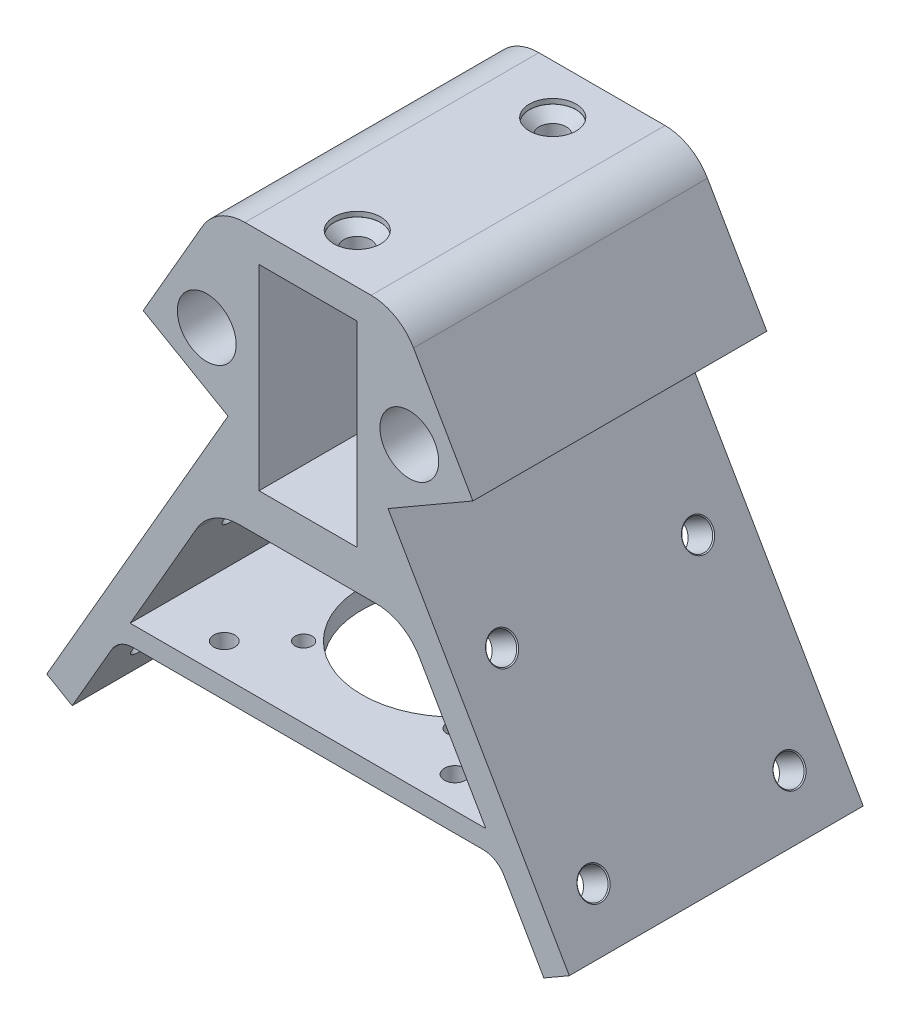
from build123d import *

# Parameters (mm, degrees)
SKETCH_1_R                 = 6
SKETCH_1_W                 = 20
SKETCH_1_H                 = 40
EXTRUDE_1_DEPTH            = 60
CUT_EXTRUDE_1_REACH        = 132.64
SKETCH_2_R                 = 2.75
SKETCH_3_R                 = 4.775
CUT_EXTRUDE_2_DEPTH        = 1
CHAMFER_1_SIZE             = 2
CUT_EXTRUDE_3_REACH        = 137.037
SKETCH_4_R                 = 2.825
CHAMFER_2_SIZE             = 0.2
CHAMFER_2_OF_MIRROR_2_SIZE = 0.2
CUT_EXTRUDE_4_REACH        = 120.059
SKETCH_5_R                 = 19
SKETCH_5_R_2               = 1.75
SKETCH_5_R_3               = 2.15
PATTERN_CIRCULAR_1_COUNT   = 4


with BuildPart() as part:
    # Sketch 1 → Extrude 1 (new body)
    with BuildSketch(Plane.XY):
        with BuildLine():
            Line((12.876497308, 100.066641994), (-12.876497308, 100.066641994))
            ThreePointArc((-12.876497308, 100.066641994), (-17.876497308, 98.726896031), (-21.536751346, 95.066641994))
            Line((-21.536751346, 95.066641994), (-33.65, 74.08587988))
            Line((-33.65, 74.08587988), (-16.329491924, 64.08587988))
            Line((-16.329491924, 64.08587988), (-53.329491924, 0))
            Line((-53.329491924, 0), (-48.133339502, -3))
            Line((-48.133339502, -3), (-40.050435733, 11))
            ThreePointArc((-40.050435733, 11), (-38.220308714, 12.830127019), (-35.720308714, 13.5))
            Line((-35.720308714, 13.5), (35.720308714, 13.5))
            ThreePointArc((35.720308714, 13.5), (38.220308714, 12.830127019), (40.050435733, 11))
            Line((40.050435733, 11), (48.133339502, -3))
            Line((48.133339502, -3), (53.329491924, 0))
            Line((53.329491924, 0), (16.329491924, 64.08587988))
            Line((16.329491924, 64.08587988), (33.65, 74.08587988))
            Line((33.65, 74.08587988), (21.536751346, 95.066641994))
            ThreePointArc((21.536751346, 95.066641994), (17.876497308, 98.726896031), (12.876497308, 100.066641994))
        make_face()
        with Locations((-20.672758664, 77.563121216)):
            Circle(SKETCH_1_R, mode=Mode.SUBTRACT)
        with Locations((20.672758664, 77.563121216)):
            Circle(SKETCH_1_R, mode=Mode.SUBTRACT)
        with BuildLine():
            Line((-14.031197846, 46.066641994), (14.031197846, 46.066641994))
            ThreePointArc((14.031197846, 46.066641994), (19.031197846, 44.726896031), (22.691451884, 41.066641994))
            Line((22.691451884, 41.066641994), (36.297658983, 17.5))
            Line((36.297658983, 17.5), (-36.297658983, 17.5))
            Line((-36.297658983, 17.5), (-22.691451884, 41.066641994))
            ThreePointArc((-22.691451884, 41.066641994), (-19.031197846, 44.726896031), (-14.031197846, 46.066641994))
        make_face(mode=Mode.SUBTRACT)
        with Locations((0, 74.066641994)):
            Rectangle(SKETCH_1_W, SKETCH_1_H, mode=Mode.SUBTRACT)
    extrude(amount=EXTRUDE_1_DEPTH)

    # Sketch 2 → Cut-Extrude 1 (cut, up to next)
    with BuildSketch(Plane(origin=(0, 100.066641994, 0), x_dir=(1, 0, 0), z_dir=(0, 1, 0)), mode=Mode.PRIVATE) as cut_extrude_1_sk1:
        with Locations(Location((0, -49.95, 0), (0, 0, 180))):
            Circle(SKETCH_2_R)
    cut_extrude_1_tool1 = extrude(cut_extrude_1_sk1.sketch, amount=-CUT_EXTRUDE_1_REACH, mode=Mode.PRIVATE) & part.part
    # Sketch 2 → Cut-Extrude 1 (cut, up to next)
    with BuildSketch(Plane(origin=(0, 100.066641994, 0), x_dir=(1, 0, 0), z_dir=(0, 1, 0)), mode=Mode.PRIVATE) as cut_extrude_1_sk2:
        with Locations(Location((0, -10.05, 0), (0, 0, 180))):
            Circle(SKETCH_2_R)
    cut_extrude_1_tool2 = extrude(cut_extrude_1_sk2.sketch, amount=-CUT_EXTRUDE_1_REACH, mode=Mode.PRIVATE) & part.part
    add(cut_extrude_1_tool1.solids().sort_by_distance((0, 100.066642, 49.95))[0], mode=Mode.SUBTRACT)
    add(cut_extrude_1_tool2.solids().sort_by_distance((0, 100.066642, 10.05))[0], mode=Mode.SUBTRACT)

    # Sketch 3 → Cut-Extrude 2 (cut)
    with BuildSketch(Plane(origin=(0, 100.066641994, 0), x_dir=(1, 0, 0), z_dir=(0, 1, 0))):
        with Locations(Location((0, -49.95, 0), (0, 0, 180))):
            Circle(SKETCH_3_R)
        with Locations(Location((0, -10.05, 0), (0, 0, 180))):
            Circle(SKETCH_3_R)
    extrude(amount=-CUT_EXTRUDE_2_DEPTH, mode=Mode.SUBTRACT)

    # Chamfer 1
    chamfer_1_edges = [part.edges().sort_by_distance(p)[0] for p in [
        (2.75, 99.066641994, 49.95),
        (2.75, 99.066641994, 10.05),
    ]]
    chamfer(chamfer_1_edges, length=CHAMFER_1_SIZE)

    # Sketch 4 → Cut-Extrude 3 (cut, up to next)
    with BuildSketch(Plane(origin=(-39.997118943, 23.092347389, 0), x_dir=(0, 0, 1), z_dir=(-0.8660254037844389, 0.49999999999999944, 0)), mode=Mode.PRIVATE) as cut_extrude_3_sk1:
        with Locations(Location((10, -16.539745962, 0), (0, 0, 270))):
            Circle(SKETCH_4_R)
    cut_extrude_3_tool1 = extrude(cut_extrude_3_sk1.sketch, amount=-CUT_EXTRUDE_3_REACH, mode=Mode.PRIVATE) & part.part
    # Sketch 4 → Cut-Extrude 3 (cut, up to next)
    with BuildSketch(Plane(origin=(-39.997118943, 23.092347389, 0), x_dir=(0, 0, 1), z_dir=(-0.8660254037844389, 0.49999999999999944, 0)), mode=Mode.PRIVATE) as cut_extrude_3_sk2:
        with Locations(Location((10, 20.760254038, 0), (0, 0, 270))):
            Circle(SKETCH_4_R)
    cut_extrude_3_tool2 = extrude(cut_extrude_3_sk2.sketch, amount=-CUT_EXTRUDE_3_REACH, mode=Mode.PRIVATE) & part.part
    # Sketch 4 → Cut-Extrude 3 (cut, up to next)
    with BuildSketch(Plane(origin=(-39.997118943, 23.092347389, 0), x_dir=(0, 0, 1), z_dir=(-0.8660254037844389, 0.49999999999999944, 0)), mode=Mode.PRIVATE) as cut_extrude_3_sk3:
        with Locations(Location((50, 20.760254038, 0), (0, 0, 270))):
            Circle(SKETCH_4_R)
    cut_extrude_3_tool3 = extrude(cut_extrude_3_sk3.sketch, amount=-CUT_EXTRUDE_3_REACH, mode=Mode.PRIVATE) & part.part
    # Sketch 4 → Cut-Extrude 3 (cut, up to next)
    with BuildSketch(Plane(origin=(-39.997118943, 23.092347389, 0), x_dir=(0, 0, 1), z_dir=(-0.8660254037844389, 0.49999999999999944, 0)), mode=Mode.PRIVATE) as cut_extrude_3_sk4:
        with Locations(Location((50, -16.539745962, 0), (0, 0, 270))):
            Circle(SKETCH_4_R)
    cut_extrude_3_tool4 = extrude(cut_extrude_3_sk4.sketch, amount=-CUT_EXTRUDE_3_REACH, mode=Mode.PRIVATE) & part.part
    cut_extrude_3_1 = cut_extrude_3_tool1.solids().sort_by_distance((-48.266992, 8.768507, 10))[0]
    add(cut_extrude_3_1, mode=Mode.SUBTRACT)
    cut_extrude_3_2 = cut_extrude_3_tool2.solids().sort_by_distance((-29.616992, 41.071255, 10))[0]
    add(cut_extrude_3_2, mode=Mode.SUBTRACT)
    cut_extrude_3_3 = cut_extrude_3_tool3.solids().sort_by_distance((-29.616992, 41.071255, 50))[0]
    add(cut_extrude_3_3, mode=Mode.SUBTRACT)
    cut_extrude_3_4 = cut_extrude_3_tool4.solids().sort_by_distance((-48.266992, 8.768507, 50))[0]
    add(cut_extrude_3_4, mode=Mode.SUBTRACT)
    cut_extrude_3 = cut_extrude_3_1 + cut_extrude_3_2 + cut_extrude_3_3 + cut_extrude_3_4  # Cut-Extrude 3 as one shape, for the pattern or mirror that repeats it

    # Chamfer 2
    chamfer_2_edges = [part.edges().sort_by_distance(p)[0] for p in [
        (-46.854491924, 11.215028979, 50),
        (-28.204491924, 43.51777654, 50),
        (-28.204491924, 43.51777654, 10),
        (-46.854491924, 11.215028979, 10),
    ]]
    chamfer(chamfer_2_edges, length=CHAMFER_2_SIZE)

    # Mirror 2: Cut-Extrude 3 across plane
    add(cut_extrude_3.mirror(Plane(origin=(0, 0, 0), x_dir=(0, 0, 1), z_dir=(1, 0, 0))), mode=Mode.SUBTRACT)

    # Chamfer 2 of Mirror 2
    chamfer_2_of_mirror_2_edges = [part.edges().sort_by_distance(p)[0] for p in [
        (46.854491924, 11.215028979, 50),
        (28.204491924, 43.51777654, 50),
        (28.204491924, 43.51777654, 10),
        (46.854491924, 11.215028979, 10),
    ]]
    chamfer(chamfer_2_of_mirror_2_edges, length=CHAMFER_2_OF_MIRROR_2_SIZE)

    # Sketch 5 → Cut-Extrude 4 (cut, up to next)
    with BuildSketch(Plane.XZ.offset(-13.5), mode=Mode.PRIVATE) as cut_extrude_4_sk1:
        with Locations((0, 30)):
            Circle(SKETCH_5_R)
    cut_extrude_4_tool1 = extrude(cut_extrude_4_sk1.sketch, amount=-CUT_EXTRUDE_4_REACH, mode=Mode.PRIVATE) & part.part
    # Sketch 5 → Cut-Extrude 4 (cut, up to next)
    with BuildSketch(Plane.XZ.offset(-13.5), mode=Mode.PRIVATE) as cut_extrude_4_sk2:
        with Locations((15.450283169, 45.450283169)):
            Circle(SKETCH_5_R_2)
    cut_extrude_4_tool2 = extrude(cut_extrude_4_sk2.sketch, amount=-CUT_EXTRUDE_4_REACH, mode=Mode.PRIVATE) & part.part
    # Sketch 5 → Cut-Extrude 4 (cut, up to next)
    with BuildSketch(Plane.XZ.offset(-13.5), mode=Mode.PRIVATE) as cut_extrude_4_sk3:
        with Locations((23.546655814, 53.546655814)):
            Circle(SKETCH_5_R_3)
    cut_extrude_4_tool3 = extrude(cut_extrude_4_sk3.sketch, amount=-CUT_EXTRUDE_4_REACH, mode=Mode.PRIVATE) & part.part
    cut_extrude_4_1 = cut_extrude_4_tool1.solids().sort_by_distance((0, 13.5, 30))[0]
    add(cut_extrude_4_1, mode=Mode.SUBTRACT)
    cut_extrude_4_2 = cut_extrude_4_tool2.solids().sort_by_distance((15.450283, 13.5, 45.450283))[0]
    add(cut_extrude_4_2, mode=Mode.SUBTRACT)
    cut_extrude_4_3 = cut_extrude_4_tool3.solids().sort_by_distance((23.546656, 13.5, 53.546656))[0]
    add(cut_extrude_4_3, mode=Mode.SUBTRACT)
    cut_extrude_4 = cut_extrude_4_1 + cut_extrude_4_2 + cut_extrude_4_3  # Cut-Extrude 4 as one shape, for the pattern or mirror that repeats it

    # Pattern Circular 1: Cut-Extrude 4 ×4 about axis
    pattern_circular_1_axis = Axis((0, 0, 30), (0, 1, 0))
    for i in range(1, PATTERN_CIRCULAR_1_COUNT):
        add(cut_extrude_4.rotate(pattern_circular_1_axis, i * 360 / PATTERN_CIRCULAR_1_COUNT), mode=Mode.SUBTRACT)


solid = part.part
